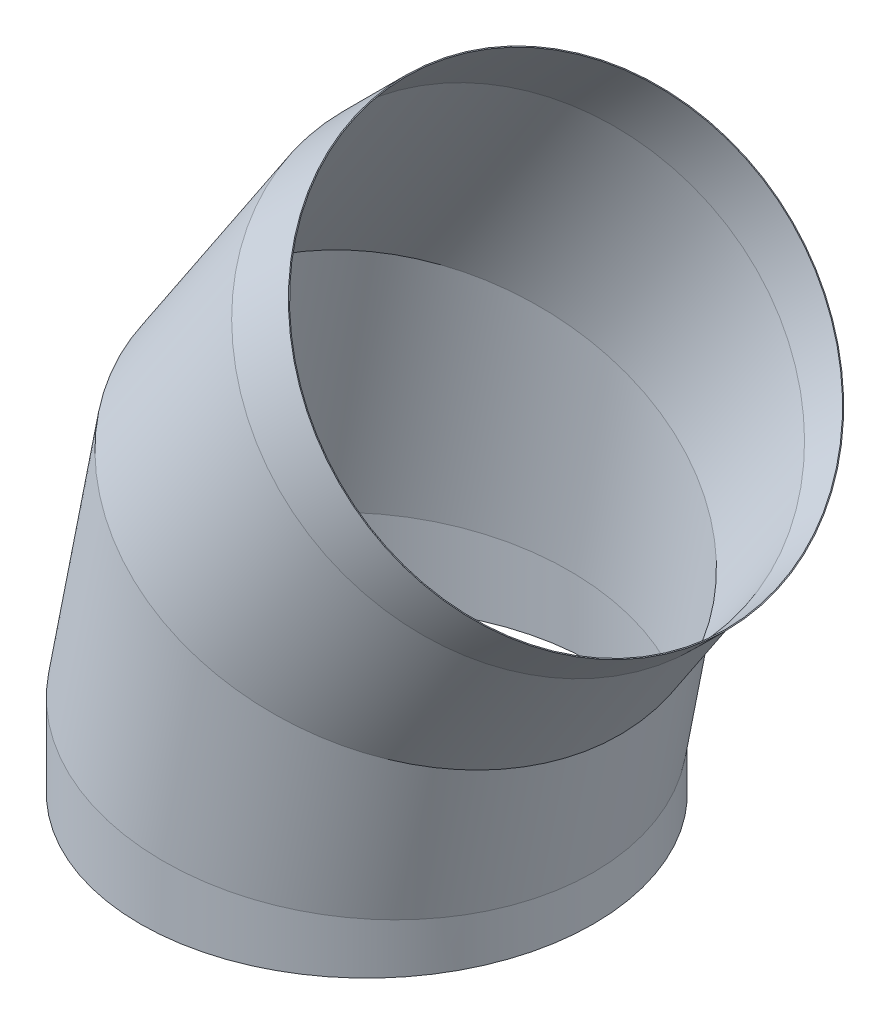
ISO-10303-21;
HEADER;
FILE_DESCRIPTION(('STEP AP214'),'2;1');
FILE_NAME('part.step','',(''),(''),'','','');
FILE_SCHEMA(('AUTOMOTIVE_DESIGN { 1 0 10303 214 1 1 1 1 }'));
ENDSEC;
DATA;
#1=APPLICATION_CONTEXT('core data for automotive mechanical design processes');
#2=APPLICATION_PROTOCOL_DEFINITION('international standard','automotive_design',2000,#1);
#3=PRODUCT_CONTEXT('',#1,'mechanical');
#4=PRODUCT('Part','Part','',(#3));
#5=PRODUCT_RELATED_PRODUCT_CATEGORY('part','',(#4));
#6=PRODUCT_DEFINITION_FORMATION('','',#4);
#7=PRODUCT_DEFINITION_CONTEXT('part definition',#1,'design');
#8=PRODUCT_DEFINITION('design','',#6,#7);
#9=PRODUCT_DEFINITION_SHAPE('','',#8);
#10=(LENGTH_UNIT() NAMED_UNIT(*) SI_UNIT(.MILLI.,.METRE.));
#11=(NAMED_UNIT(*) PLANE_ANGLE_UNIT() SI_UNIT($,.RADIAN.));
#12=(NAMED_UNIT(*) SI_UNIT($,.STERADIAN.) SOLID_ANGLE_UNIT());
#13=UNCERTAINTY_MEASURE_WITH_UNIT(LENGTH_MEASURE(1.E-05),#10,'distance_accuracy_value','');
#14=(GEOMETRIC_REPRESENTATION_CONTEXT(3) GLOBAL_UNCERTAINTY_ASSIGNED_CONTEXT((#13)) GLOBAL_UNIT_ASSIGNED_CONTEXT((#10,
#11,#12)) REPRESENTATION_CONTEXT('',''));
#15=CARTESIAN_POINT('',(0.,0.,0.));
#16=DIRECTION('',(0.,0.,1.));
#17=DIRECTION('',(1.,0.,0.));
#18=AXIS2_PLACEMENT_3D('',#15,#16,#17);
#19=CARTESIAN_POINT('',(-1060.66017177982,1060.66017177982,0.));
#20=DIRECTION('',(0.707106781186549,0.707106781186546,0.));
#21=DIRECTION('',(-0.707106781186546,0.707106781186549,0.));
#22=AXIS2_PLACEMENT_3D('',#19,#20,#21);
#23=PLANE('',#22);
#24=CARTESIAN_POINT('',(-1060.66017177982,1060.66017177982,0.));
#25=DIRECTION('',(0.707106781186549,0.707106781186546,0.));
#26=DIRECTION('',(-0.707106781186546,0.707106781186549,0.));
#27=AXIS2_PLACEMENT_3D('',#24,#25,#26);
#28=CIRCLE('',#27,500.);
#29=CARTESIAN_POINT('',(-1414.21356237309,1414.2135623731,0.));
#30=VERTEX_POINT('',#29);
#31=EDGE_CURVE('E11',#30,#30,#28,.F.);
#32=ORIENTED_EDGE('',*,*,#31,.F.);
#33=EDGE_LOOP('',(#32));
#34=FACE_BOUND('',#33,.T.);
#35=CARTESIAN_POINT('',(-1060.66017177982,1060.66017177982,0.));
#36=DIRECTION('',(0.707106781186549,0.707106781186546,0.));
#37=DIRECTION('',(-0.707106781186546,0.707106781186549,0.));
#38=AXIS2_PLACEMENT_3D('',#35,#36,#37);
#39=CIRCLE('',#38,498.);
#40=CARTESIAN_POINT('',(-1412.79934881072,1412.79934881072,0.));
#41=VERTEX_POINT('',#40);
#42=EDGE_CURVE('E56',#41,#41,#39,.F.);
#43=ORIENTED_EDGE('',*,*,#42,.T.);
#44=EDGE_LOOP('',(#43));
#45=FACE_BOUND('',#44,.T.);
#46=ADVANCED_FACE('F33',(#34,#45),#23,.T.);
#47=CARTESIAN_POINT('',(-1165.12608058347,956.194262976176,0.));
#48=DIRECTION('',(0.707106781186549,0.707106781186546,0.));
#49=DIRECTION('',(-0.707106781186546,0.707106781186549,0.));
#50=AXIS2_PLACEMENT_3D('',#47,#48,#49);
#51=CYLINDRICAL_SURFACE('',#50,500.);
#52=CARTESIAN_POINT('',(-1165.12608058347,956.194262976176,0.));
#53=DIRECTION('',(0.634393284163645,0.773010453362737,0.));
#54=DIRECTION('',(-0.773010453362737,0.634393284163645,0.));
#55=AXIS2_PLACEMENT_3D('',#52,#53,#54);
#56=ELLIPSE('',#55,502.419286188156,500.);
#57=CARTESIAN_POINT('',(-1553.50144077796,1274.92568396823,0.));
#58=VERTEX_POINT('',#57);
#59=EDGE_CURVE('E40',#58,#58,#56,.T.);
#60=ORIENTED_EDGE('',*,*,#59,.T.);
#61=EDGE_LOOP('',(#60));
#62=FACE_BOUND('',#61,.T.);
#63=ORIENTED_EDGE('',*,*,#31,.T.);
#64=EDGE_LOOP('',(#63));
#65=FACE_BOUND('',#64,.T.);
#66=ADVANCED_FACE('F35',(#62,#65),#51,.T.);
#67=CARTESIAN_POINT('',(-1412.96910389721,585.270966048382,0.));
#68=DIRECTION('',(0.5555702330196,0.831469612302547,0.));
#69=DIRECTION('',(-0.831469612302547,0.5555702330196,0.));
#70=AXIS2_PLACEMENT_3D('',#67,#68,#69);
#71=CYLINDRICAL_SURFACE('',#70,500.);
#72=CARTESIAN_POINT('',(-1412.96910389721,585.270966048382,0.));
#73=DIRECTION('',(0.382683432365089,0.923879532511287,0.));
#74=DIRECTION('',(-0.923879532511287,0.382683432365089,0.));
#75=AXIS2_PLACEMENT_3D('',#72,#73,#74);
#76=ELLIPSE('',#75,509.795579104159,500.);
#77=CARTESIAN_POINT('',(-1883.95880519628,780.36128806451,0.));
#78=VERTEX_POINT('',#77);
#79=EDGE_CURVE('E44',#78,#78,#76,.F.);
#80=ORIENTED_EDGE('',*,*,#79,.F.);
#81=EDGE_LOOP('',(#80));
#82=FACE_BOUND('',#81,.T.);
#83=ORIENTED_EDGE('',*,*,#59,.F.);
#84=EDGE_LOOP('',(#83));
#85=FACE_BOUND('',#84,.T.);
#86=ADVANCED_FACE('F87',(#82,#85),#71,.T.);
#87=CARTESIAN_POINT('',(-1500.,147.737105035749,0.));
#88=DIRECTION('',(0.195090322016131,0.98078528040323,0.));
#89=DIRECTION('',(-0.98078528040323,0.195090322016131,0.));
#90=AXIS2_PLACEMENT_3D('',#87,#88,#89);
#91=CYLINDRICAL_SURFACE('',#90,500.);
#92=CARTESIAN_POINT('',(-1500.,147.737105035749,0.));
#93=DIRECTION('',(0.0980171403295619,0.995184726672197,0.));
#94=DIRECTION('',(0.995184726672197,-0.0980171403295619,0.));
#95=AXIS2_PLACEMENT_3D('',#92,#93,#94);
#96=ELLIPSE('',#95,502.419286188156,500.);
#97=CARTESIAN_POINT('',(-1000.,98.4914033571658,0.));
#98=VERTEX_POINT('',#97);
#99=EDGE_CURVE('E48',#98,#98,#96,.T.);
#100=ORIENTED_EDGE('',*,*,#99,.T.);
#101=EDGE_LOOP('',(#100));
#102=FACE_BOUND('',#101,.T.);
#103=ORIENTED_EDGE('',*,*,#79,.T.);
#104=EDGE_LOOP('',(#103));
#105=FACE_BOUND('',#104,.T.);
#106=ADVANCED_FACE('F98',(#102,#105),#91,.T.);
#107=CARTESIAN_POINT('',(-1500.,1561.95066740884,0.));
#108=DIRECTION('',(0.,-1.,0.));
#109=DIRECTION('',(0.,0.,-1.));
#110=AXIS2_PLACEMENT_3D('',#107,#108,#109);
#111=CYLINDRICAL_SURFACE('',#110,500.);
#112=CARTESIAN_POINT('',(-1500.,0.,0.));
#113=DIRECTION('',(0.,1.,0.));
#114=DIRECTION('',(0.,0.,1.));
#115=AXIS2_PLACEMENT_3D('',#112,#113,#114);
#116=CIRCLE('',#115,500.);
#117=CARTESIAN_POINT('',(-1500.,0.,500.));
#118=VERTEX_POINT('',#117);
#119=EDGE_CURVE('E53',#118,#118,#116,.T.);
#120=ORIENTED_EDGE('',*,*,#119,.T.);
#121=EDGE_LOOP('',(#120));
#122=FACE_BOUND('',#121,.T.);
#123=ORIENTED_EDGE('',*,*,#99,.F.);
#124=EDGE_LOOP('',(#123));
#125=FACE_BOUND('',#124,.T.);
#126=ADVANCED_FACE('F94',(#122,#125),#111,.T.);
#127=CARTESIAN_POINT('',(-1500.,0.,0.));
#128=DIRECTION('',(0.,1.,0.));
#129=DIRECTION('',(0.,0.,1.));
#130=AXIS2_PLACEMENT_3D('',#127,#128,#129);
#131=PLANE('',#130);
#132=CARTESIAN_POINT('',(-1500.,0.,0.));
#133=DIRECTION('',(0.,1.,0.));
#134=DIRECTION('',(0.,0.,1.));
#135=AXIS2_PLACEMENT_3D('',#132,#133,#134);
#136=CIRCLE('',#135,498.);
#137=CARTESIAN_POINT('',(-1500.,0.,498.));
#138=VERTEX_POINT('',#137);
#139=EDGE_CURVE('E57',#138,#138,#136,.T.);
#140=ORIENTED_EDGE('',*,*,#139,.T.);
#141=EDGE_LOOP('',(#140));
#142=FACE_BOUND('',#141,.T.);
#143=ORIENTED_EDGE('',*,*,#119,.F.);
#144=EDGE_LOOP('',(#143));
#145=FACE_BOUND('',#144,.T.);
#146=ADVANCED_FACE('F77',(#142,#145),#131,.F.);
#147=CARTESIAN_POINT('',(-1165.12608058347,956.194262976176,0.));
#148=DIRECTION('',(0.707106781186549,0.707106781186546,0.));
#149=DIRECTION('',(-0.707106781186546,0.707106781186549,0.));
#150=AXIS2_PLACEMENT_3D('',#147,#148,#149);
#151=CYLINDRICAL_SURFACE('',#150,498.);
#152=CARTESIAN_POINT('',(-1165.12608058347,956.194262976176,0.));
#153=DIRECTION('',(0.634393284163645,0.773010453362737,0.));
#154=DIRECTION('',(0.773010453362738,-0.634393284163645,0.));
#155=AXIS2_PLACEMENT_3D('',#152,#153,#154);
#156=ELLIPSE('',#155,500.409609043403,498.);
#157=CARTESIAN_POINT('',(-778.304221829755,638.737767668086,0.));
#158=VERTEX_POINT('',#157);
#159=EDGE_CURVE('E63',#158,#158,#156,.T.);
#160=ORIENTED_EDGE('',*,*,#159,.F.);
#161=EDGE_LOOP('',(#160));
#162=FACE_BOUND('',#161,.T.);
#163=ORIENTED_EDGE('',*,*,#42,.F.);
#164=EDGE_LOOP('',(#163));
#165=FACE_BOUND('',#164,.T.);
#166=ADVANCED_FACE('F74',(#162,#165),#151,.F.);
#167=CARTESIAN_POINT('',(-1412.96910389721,585.270966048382,0.));
#168=DIRECTION('',(0.5555702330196,0.831469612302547,0.));
#169=DIRECTION('',(-0.831469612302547,0.5555702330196,0.));
#170=AXIS2_PLACEMENT_3D('',#167,#168,#169);
#171=CYLINDRICAL_SURFACE('',#170,498.);
#172=CARTESIAN_POINT('',(-1412.96910389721,585.270966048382,0.));
#173=DIRECTION('',(0.382683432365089,0.923879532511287,0.));
#174=DIRECTION('',(-0.923879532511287,0.38268343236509,0.));
#175=AXIS2_PLACEMENT_3D('',#172,#173,#174);
#176=ELLIPSE('',#175,507.756396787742,498.);
#177=CARTESIAN_POINT('',(-1882.07484639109,779.580926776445,0.));
#178=VERTEX_POINT('',#177);
#179=EDGE_CURVE('E66',#178,#178,#176,.F.);
#180=ORIENTED_EDGE('',*,*,#179,.T.);
#181=EDGE_LOOP('',(#180));
#182=FACE_BOUND('',#181,.T.);
#183=ORIENTED_EDGE('',*,*,#159,.T.);
#184=EDGE_LOOP('',(#183));
#185=FACE_BOUND('',#184,.T.);
#186=ADVANCED_FACE('F72',(#182,#185),#171,.F.);
#187=CARTESIAN_POINT('',(-1500.,147.737105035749,0.));
#188=DIRECTION('',(0.195090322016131,0.98078528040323,0.));
#189=DIRECTION('',(-0.98078528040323,0.195090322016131,0.));
#190=AXIS2_PLACEMENT_3D('',#187,#188,#189);
#191=CYLINDRICAL_SURFACE('',#190,498.);
#192=CARTESIAN_POINT('',(-1500.,147.737105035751,0.));
#193=DIRECTION('',(-0.0980171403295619,-0.995184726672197,0.));
#194=DIRECTION('',(0.995184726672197,-0.0980171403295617,0.));
#195=AXIS2_PLACEMENT_3D('',#192,#193,#194);
#196=ELLIPSE('',#195,500.409609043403,498.);
#197=CARTESIAN_POINT('',(-1002.,98.688386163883,0.));
#198=VERTEX_POINT('',#197);
#199=EDGE_CURVE('E60',#198,#198,#196,.F.);
#200=ORIENTED_EDGE('',*,*,#199,.F.);
#201=EDGE_LOOP('',(#200));
#202=FACE_BOUND('',#201,.T.);
#203=ORIENTED_EDGE('',*,*,#179,.F.);
#204=EDGE_LOOP('',(#203));
#205=FACE_BOUND('',#204,.T.);
#206=ADVANCED_FACE('F133',(#202,#205),#191,.F.);
#207=CARTESIAN_POINT('',(-1500.,1561.95066740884,0.));
#208=DIRECTION('',(0.,-1.,0.));
#209=DIRECTION('',(0.,0.,-1.));
#210=AXIS2_PLACEMENT_3D('',#207,#208,#209);
#211=CYLINDRICAL_SURFACE('',#210,498.);
#212=ORIENTED_EDGE('',*,*,#139,.F.);
#213=EDGE_LOOP('',(#212));
#214=FACE_BOUND('',#213,.T.);
#215=ORIENTED_EDGE('',*,*,#199,.T.);
#216=EDGE_LOOP('',(#215));
#217=FACE_BOUND('',#216,.T.);
#218=ADVANCED_FACE('F90',(#214,#217),#211,.F.);
#219=CLOSED_SHELL('',(#46,#66,#86,#106,#126,#146,#166,#186,#206,#218));
#220=MANIFOLD_SOLID_BREP('B2',#219);
#221=ADVANCED_BREP_SHAPE_REPRESENTATION('',(#18,#220),#14);
#222=SHAPE_DEFINITION_REPRESENTATION(#9,#221);
ENDSEC;
END-ISO-10303-21;
